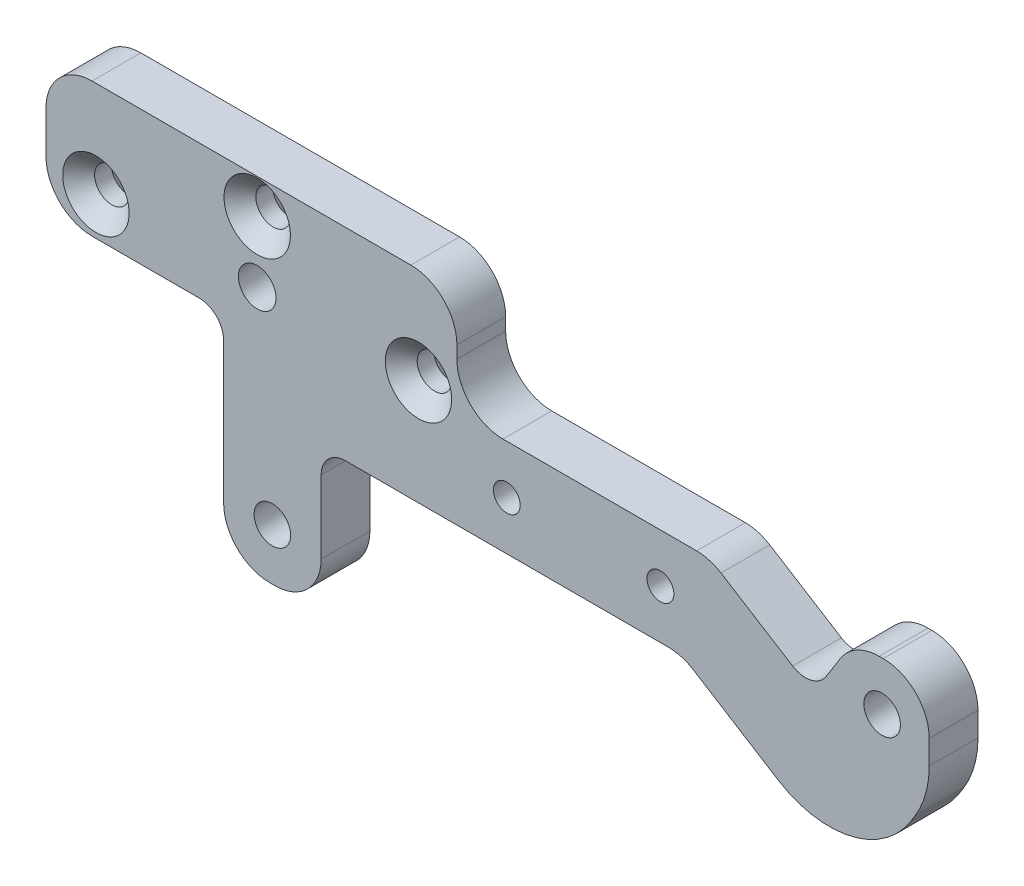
from build123d import *

# Parameters (mm, degrees)
SKETCH1_W                                       = 230
SKETCH1_H                                       = 90
BOSS_EXTRUDE1_DEPTH                             = 12.7
SKETCH2_R                                       = 4.9
CUT_EXTRUDE1_DEPTH                              = 188.1130407
CSK_FOR_M8_FLAT_HEAD_MACHINE_SCREW1_D           = 9
CSK_FOR_M8_FLAT_HEAD_MACHINE_SCREW1_CSINK_D     = 17.3
CSK_FOR_M8_FLAT_HEAD_MACHINE_SCREW1_CSINK_ANGLE = 90
SKETCH5_R                                       = 4.7625
CUT_EXTRUDE2_DEPTH                              = 188.1130407
SKETCH6_R                                       = 4.7625
CUT_EXTRUDE3_DEPTH                              = 188.1130407
SKETCH7_W                                       = 46.25
SKETCH7_H                                       = 55
SKETCH7_W_2                                     = 123
SKETCH7_H_2                                     = 27.24
SKETCH7_W_3                                     = 158.35
SKETCH7_H_3                                     = 37.36
CUT_EXTRUDE4_DEPTH                              = 188.1130407
CUT_EXTRUDE6_DEPTH                              = 188.1130407
BOSS_EXTRUDE2_DEPTH                             = 12.7
FILLET2_R                                       = 12
FILLET3_R                                       = 6.35
FILLET6_R                                       = 25
FILLET7_R                                       = 12
M8X1_0_TAPPED_HOLE1_D                           = 7
CHAMFER2_SIZE                                   = 4.15


with BuildPart() as part:
    # Sketch1 → Boss-Extrude1 (new body)
    with BuildSketch(Plane.XY):
        with Locations((60, -20)):
            Rectangle(SKETCH1_W, SKETCH1_H)
    extrude(amount=BOSS_EXTRUDE1_DEPTH)

    # Sketch2 → Cut-Extrude1 (cut, through all)
    with BuildSketch(Plane.XY.offset(12.7)):
        Circle(SKETCH2_R)
    extrude(amount=-CUT_EXTRUDE1_DEPTH, mode=Mode.SUBTRACT)

    # CSK for M8 Flat Head Machine Screw1 (through all)
    with Locations(Plane.XY.offset(12.7)):
        with Locations((-42, 0), (0, 16), (42, 0)):
            CounterSinkHole(CSK_FOR_M8_FLAT_HEAD_MACHINE_SCREW1_D / 2, CSK_FOR_M8_FLAT_HEAD_MACHINE_SCREW1_CSINK_D / 2, counter_sink_angle=CSK_FOR_M8_FLAT_HEAD_MACHINE_SCREW1_CSINK_ANGLE)

    # Sketch5 → Cut-Extrude2 (cut, through all)
    with BuildSketch(Plane.XY.offset(12.7)):
        with Locations((162.72, -14.94)):
            Circle(SKETCH5_R)
    extrude(amount=-CUT_EXTRUDE2_DEPTH, mode=Mode.SUBTRACT)

    # Sketch6 → Cut-Extrude3 (cut, through all)
    with BuildSketch(Plane.XY.offset(12.7)):
        with Locations((3.95, -51.6)):
            Circle(SKETCH6_R)
    extrude(amount=-CUT_EXTRUDE3_DEPTH, mode=Mode.SUBTRACT)

    # Sketch7 → Cut-Extrude4 (cut, through all)
    with BuildSketch(Plane.XY.offset(12.7)):
        with Locations((-31.875, -37.5)):
            Rectangle(SKETCH7_W, SKETCH7_H)
        with Locations((113.5, 11.38)):
            Rectangle(SKETCH7_W_2, SKETCH7_H_2)
        with Locations((95.825, -46.32)):
            Rectangle(SKETCH7_W_3, SKETCH7_H_3)
    extrude(amount=-CUT_EXTRUDE4_DEPTH, mode=Mode.SUBTRACT)

    # Sketch11 → Cut-Extrude6 (cut, through all)
    with BuildSketch(Plane.XY.offset(12.7)):
        Polygon((155.326521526, -2.24), (144.806424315, -19.075674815), (117.863712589, -2.24), align=None)
    extrude(amount=-CUT_EXTRUDE6_DEPTH, mode=Mode.SUBTRACT)

    # Sketch13 → Boss-Extrude2 (add)
    with BuildSketch(Plane.XY):
        Polygon((110.580379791, -27.64), (156.910041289, -56.589985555), (175, -27.64), align=None)
    extrude(amount=BOSS_EXTRUDE2_DEPTH)

    # Fillet2
    fillet2_edges = [part.edges().sort_by_distance(p)[0] for p in [
        (-55, -10, 6.35),
        (-8.75, -65, 6.35),
        (175, -2.24, 6.35),
        (52, -2.24, 6.35),
        (52, 25, 6.35),
        (-55, 25, 6.35),
        (16.65, -65, 6.35),
        (117.863712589, -2.24, 6.35),
        (155.326521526, -2.24, 6.35),
    ]]
    fillet(fillet2_edges, radius=FILLET2_R)

    # Fillet3
    fillet3_edges = [part.edges().sort_by_distance(p)[0] for p in [
        (-8.75, -10, 6.35),
        (16.65, -27.64, 6.35),
        (144.806424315, -19.075674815, 6.35),
    ]]
    fillet(fillet3_edges, radius=FILLET3_R)

    # Fillet6
    fillet6_edges = [part.edges().sort_by_distance(p)[0] for p in [
        (156.910041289, -56.589985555, 6.35),
        (175, -27.64, 6.35),
    ]]
    fillet(fillet6_edges, radius=FILLET6_R)

    # Fillet7
    fillet7_edges = [part.edges().sort_by_distance(p)[0] for p in [
        (110.580379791, -27.64, 6.35),
    ]]
    fillet(fillet7_edges, radius=FILLET7_R)

    # M8x1.0 Tapped Hole1 (through all)
    with Locations(Plane.XY.offset(12.7)):
        with Locations((65, -14.94), (105, -14.94)):
            Hole(M8X1_0_TAPPED_HOLE1_D / 2)

    # Chamfer2
    chamfer2_edges = [part.edges().sort_by_distance(p)[0] for p in [
        (46.5, 0, 0),
        (4.5, 16, 0),
        (-37.5, 0, 0),
    ]]
    chamfer(chamfer2_edges, length=CHAMFER2_SIZE)


solid = part.part
